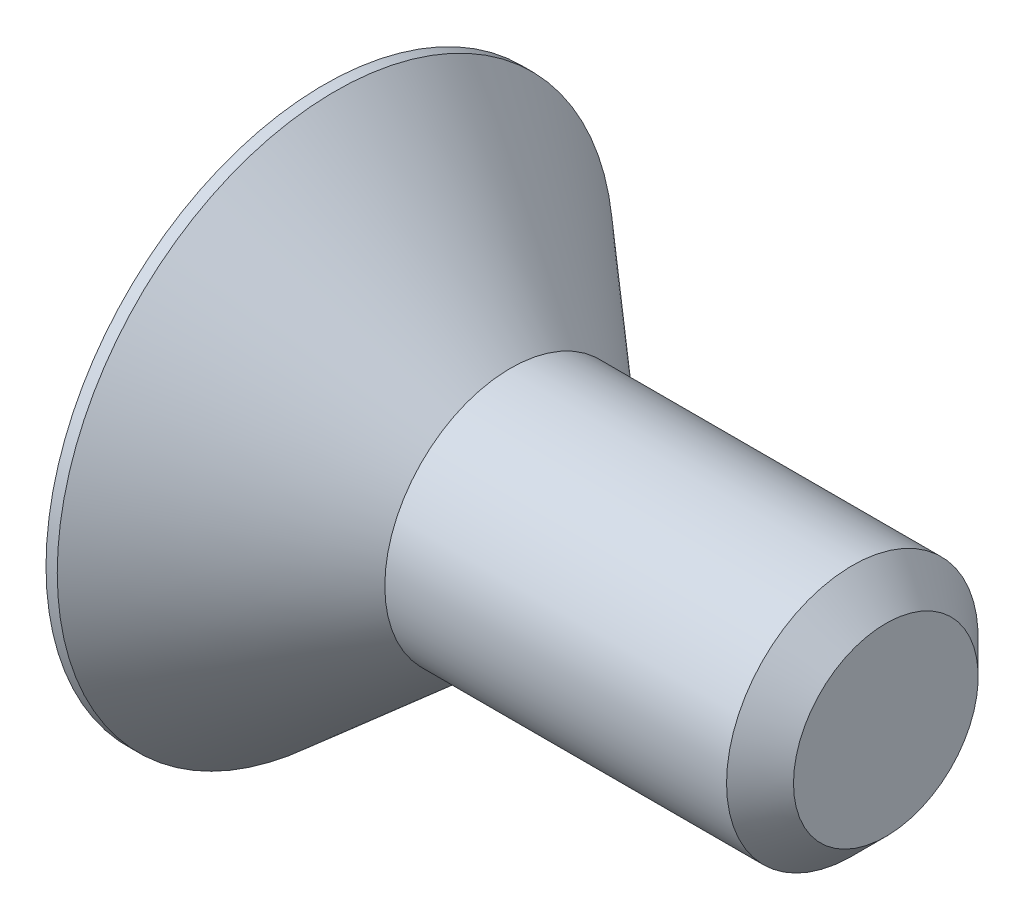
ISO-10303-21;
HEADER;
FILE_DESCRIPTION(('STEP AP214'),'2;1');
FILE_NAME('part.step','',(''),(''),'','','');
FILE_SCHEMA(('AUTOMOTIVE_DESIGN { 1 0 10303 214 1 1 1 1 }'));
ENDSEC;
DATA;
#1=APPLICATION_CONTEXT('core data for automotive mechanical design processes');
#2=APPLICATION_PROTOCOL_DEFINITION('international standard','automotive_design',2000,#1);
#3=PRODUCT_CONTEXT('',#1,'mechanical');
#4=PRODUCT('Part','Part','',(#3));
#5=PRODUCT_RELATED_PRODUCT_CATEGORY('part','',(#4));
#6=PRODUCT_DEFINITION_FORMATION('','',#4);
#7=PRODUCT_DEFINITION_CONTEXT('part definition',#1,'design');
#8=PRODUCT_DEFINITION('design','',#6,#7);
#9=PRODUCT_DEFINITION_SHAPE('','',#8);
#10=(LENGTH_UNIT() NAMED_UNIT(*) SI_UNIT(.MILLI.,.METRE.));
#11=(NAMED_UNIT(*) PLANE_ANGLE_UNIT() SI_UNIT($,.RADIAN.));
#12=(NAMED_UNIT(*) SI_UNIT($,.STERADIAN.) SOLID_ANGLE_UNIT());
#13=UNCERTAINTY_MEASURE_WITH_UNIT(LENGTH_MEASURE(1.E-05),#10,'distance_accuracy_value','');
#14=(GEOMETRIC_REPRESENTATION_CONTEXT(3) GLOBAL_UNCERTAINTY_ASSIGNED_CONTEXT((#13)) GLOBAL_UNIT_ASSIGNED_CONTEXT((#10,
#11,#12)) REPRESENTATION_CONTEXT('',''));
#15=CARTESIAN_POINT('',(0.,0.,0.));
#16=DIRECTION('',(0.,0.,1.));
#17=DIRECTION('',(1.,0.,0.));
#18=AXIS2_PLACEMENT_3D('',#15,#16,#17);
#19=CARTESIAN_POINT('',(0.,0.,0.));
#20=DIRECTION('',(-1.,0.,0.));
#21=DIRECTION('',(0.,0.,1.));
#22=AXIS2_PLACEMENT_3D('',#19,#20,#21);
#23=PLANE('',#22);
#24=CARTESIAN_POINT('',(0.,0.,0.));
#25=DIRECTION('',(-1.,0.,0.));
#26=DIRECTION('',(0.,0.,1.));
#27=AXIS2_PLACEMENT_3D('',#24,#25,#26);
#28=CIRCLE('',#27,3.14452);
#29=CARTESIAN_POINT('',(0.,0.,3.14452));
#30=VERTEX_POINT('',#29);
#31=EDGE_CURVE('E11',#30,#30,#28,.T.);
#32=ORIENTED_EDGE('',*,*,#31,.T.);
#33=EDGE_LOOP('',(#32));
#34=FACE_BOUND('',#33,.T.);
#35=DIRECTION('',(0.,-0.500000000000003,-0.866025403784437));
#36=VECTOR('',#35,1.);
#37=CARTESIAN_POINT('',(0.,-0.458271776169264,0.793749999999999));
#38=LINE('',#37,#36);
#39=CARTESIAN_POINT('',(0.,-0.458271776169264,0.793749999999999));
#40=VERTEX_POINT('',#39);
#41=CARTESIAN_POINT('',(0.,-0.916543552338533,0.));
#42=VERTEX_POINT('',#41);
#43=EDGE_CURVE('E117',#40,#42,#38,.T.);
#44=ORIENTED_EDGE('',*,*,#43,.T.);
#45=DIRECTION('',(0.,0.500000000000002,-0.866025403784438));
#46=VECTOR('',#45,1.);
#47=CARTESIAN_POINT('',(0.,-0.916543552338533,0.));
#48=LINE('',#47,#46);
#49=CARTESIAN_POINT('',(0.,-0.458271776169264,-0.793750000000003));
#50=VERTEX_POINT('',#49);
#51=EDGE_CURVE('E47',#42,#50,#48,.T.);
#52=ORIENTED_EDGE('',*,*,#51,.T.);
#53=DIRECTION('',(0.,1.,0.));
#54=VECTOR('',#53,1.);
#55=CARTESIAN_POINT('',(0.,-0.458271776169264,-0.793750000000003));
#56=LINE('',#55,#54);
#57=CARTESIAN_POINT('',(0.,0.458271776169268,-0.79375));
#58=VERTEX_POINT('',#57);
#59=EDGE_CURVE('E132',#50,#58,#56,.T.);
#60=ORIENTED_EDGE('',*,*,#59,.T.);
#61=DIRECTION('',(0.,0.500000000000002,0.866025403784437));
#62=VECTOR('',#61,1.);
#63=CARTESIAN_POINT('',(0.,0.458271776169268,-0.79375));
#64=LINE('',#63,#62);
#65=CARTESIAN_POINT('',(0.,0.916543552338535,0.));
#66=VERTEX_POINT('',#65);
#67=EDGE_CURVE('E202',#58,#66,#64,.T.);
#68=ORIENTED_EDGE('',*,*,#67,.T.);
#69=DIRECTION('',(0.,-0.5,0.866025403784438));
#70=VECTOR('',#69,1.);
#71=CARTESIAN_POINT('',(0.,0.916543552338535,0.));
#72=LINE('',#71,#70);
#73=CARTESIAN_POINT('',(0.,0.458271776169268,0.793749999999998));
#74=VERTEX_POINT('',#73);
#75=EDGE_CURVE('E186',#66,#74,#72,.T.);
#76=ORIENTED_EDGE('',*,*,#75,.T.);
#77=DIRECTION('',(0.,-1.,0.));
#78=VECTOR('',#77,1.);
#79=CARTESIAN_POINT('',(0.,0.458271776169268,0.793749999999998));
#80=LINE('',#79,#78);
#81=EDGE_CURVE('E181',#74,#40,#80,.T.);
#82=ORIENTED_EDGE('',*,*,#81,.T.);
#83=EDGE_LOOP('',(#44,#52,#60,#68,#76,#82));
#84=FACE_BOUND('',#83,.T.);
#85=ADVANCED_FACE('F33',(#34,#84),#23,.T.);
#86=CARTESIAN_POINT('',(0.,0.,0.));
#87=DIRECTION('',(-1.,0.,0.));
#88=DIRECTION('',(0.,0.,1.));
#89=AXIS2_PLACEMENT_3D('',#86,#87,#88);
#90=CYLINDRICAL_SURFACE('',#89,3.14452);
#91=CARTESIAN_POINT('',(0.127,0.,0.));
#92=DIRECTION('',(-1.,0.,0.));
#93=DIRECTION('',(0.,0.,1.));
#94=AXIS2_PLACEMENT_3D('',#91,#92,#93);
#95=CIRCLE('',#94,3.14452);
#96=CARTESIAN_POINT('',(0.127,0.,3.14452));
#97=VERTEX_POINT('',#96);
#98=EDGE_CURVE('E40',#97,#97,#95,.T.);
#99=ORIENTED_EDGE('',*,*,#98,.T.);
#100=EDGE_LOOP('',(#99));
#101=FACE_BOUND('',#100,.T.);
#102=ORIENTED_EDGE('',*,*,#31,.F.);
#103=EDGE_LOOP('',(#102));
#104=FACE_BOUND('',#103,.T.);
#105=ADVANCED_FACE('F157',(#101,#104),#90,.T.);
#106=CARTESIAN_POINT('',(0.127,0.,0.));
#107=DIRECTION('',(-1.,0.,0.));
#108=DIRECTION('',(0.,0.,1.));
#109=AXIS2_PLACEMENT_3D('',#106,#107,#108);
#110=CONICAL_SURFACE('',#109,3.14452,0.715584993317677);
#111=CARTESIAN_POINT('',(2.10807244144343,0.,0.));
#112=DIRECTION('',(-1.,0.,0.));
#113=DIRECTION('',(0.,0.,1.));
#114=AXIS2_PLACEMENT_3D('',#111,#112,#113);
#115=CIRCLE('',#114,1.4224);
#116=CARTESIAN_POINT('',(2.10807244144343,0.,1.4224));
#117=VERTEX_POINT('',#116);
#118=EDGE_CURVE('E152',#117,#117,#115,.T.);
#119=ORIENTED_EDGE('',*,*,#118,.T.);
#120=EDGE_LOOP('',(#119));
#121=FACE_BOUND('',#120,.T.);
#122=ORIENTED_EDGE('',*,*,#98,.F.);
#123=EDGE_LOOP('',(#122));
#124=FACE_BOUND('',#123,.T.);
#125=ADVANCED_FACE('F160',(#121,#124),#110,.T.);
#126=CARTESIAN_POINT('',(0.,0.,0.));
#127=DIRECTION('',(-1.,0.,0.));
#128=DIRECTION('',(0.,0.,1.));
#129=AXIS2_PLACEMENT_3D('',#126,#127,#128);
#130=CYLINDRICAL_SURFACE('',#129,1.4224);
#131=CARTESIAN_POINT('',(5.97154000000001,0.,0.));
#132=DIRECTION('',(-1.,0.,0.));
#133=DIRECTION('',(0.,0.,1.));
#134=AXIS2_PLACEMENT_3D('',#131,#132,#133);
#135=CIRCLE('',#134,1.4224);
#136=CARTESIAN_POINT('',(5.97154000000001,0.,1.4224));
#137=VERTEX_POINT('',#136);
#138=EDGE_CURVE('E149',#137,#137,#135,.T.);
#139=ORIENTED_EDGE('',*,*,#138,.T.);
#140=EDGE_LOOP('',(#139));
#141=FACE_BOUND('',#140,.T.);
#142=ORIENTED_EDGE('',*,*,#118,.F.);
#143=EDGE_LOOP('',(#142));
#144=FACE_BOUND('',#143,.T.);
#145=ADVANCED_FACE('F162',(#141,#144),#130,.T.);
#146=CARTESIAN_POINT('',(6.34999999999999,0.,0.));
#147=DIRECTION('',(-1.,0.,0.));
#148=DIRECTION('',(0.,0.,1.));
#149=AXIS2_PLACEMENT_3D('',#146,#147,#148);
#150=CONICAL_SURFACE('',#149,1.04394,0.785398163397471);
#151=ORIENTED_EDGE('',*,*,#138,.F.);
#152=EDGE_LOOP('',(#151));
#153=FACE_BOUND('',#152,.T.);
#154=CARTESIAN_POINT('',(6.34999999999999,0.,0.));
#155=DIRECTION('',(-1.,0.,0.));
#156=DIRECTION('',(0.,0.,1.));
#157=AXIS2_PLACEMENT_3D('',#154,#155,#156);
#158=CIRCLE('',#157,1.04394);
#159=CARTESIAN_POINT('',(6.34999999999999,0.,1.04394));
#160=VERTEX_POINT('',#159);
#161=EDGE_CURVE('E145',#160,#160,#158,.T.);
#162=ORIENTED_EDGE('',*,*,#161,.T.);
#163=EDGE_LOOP('',(#162));
#164=FACE_BOUND('',#163,.T.);
#165=ADVANCED_FACE('F169',(#153,#164),#150,.T.);
#166=CARTESIAN_POINT('',(6.34999999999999,1.04394,0.));
#167=DIRECTION('',(1.,0.,0.));
#168=DIRECTION('',(0.,0.,-1.));
#169=AXIS2_PLACEMENT_3D('',#166,#167,#168);
#170=PLANE('',#169);
#171=ORIENTED_EDGE('',*,*,#161,.F.);
#172=EDGE_LOOP('',(#171));
#173=FACE_BOUND('',#172,.T.);
#174=ADVANCED_FACE('F257',(#173),#170,.T.);
#175=CARTESIAN_POINT('',(1.397,-0.916543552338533,0.));
#176=DIRECTION('',(0.,0.866025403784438,0.500000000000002));
#177=DIRECTION('',(0.,-0.500000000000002,0.866025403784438));
#178=AXIS2_PLACEMENT_3D('',#175,#176,#177);
#179=PLANE('',#178);
#180=ORIENTED_EDGE('',*,*,#51,.F.);
#181=DIRECTION('',(-1.,0.,0.));
#182=VECTOR('',#181,1.);
#183=CARTESIAN_POINT('',(1.397,-0.916543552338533,0.));
#184=LINE('',#183,#182);
#185=CARTESIAN_POINT('',(1.397,-0.916543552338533,0.));
#186=VERTEX_POINT('',#185);
#187=EDGE_CURVE('E190',#186,#42,#184,.T.);
#188=ORIENTED_EDGE('',*,*,#187,.F.);
#189=DIRECTION('',(0.,0.500000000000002,-0.866025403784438));
#190=VECTOR('',#189,1.);
#191=CARTESIAN_POINT('',(1.397,-0.916543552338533,0.));
#192=LINE('',#191,#190);
#193=CARTESIAN_POINT('',(1.397,-0.687407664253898,-0.396875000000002));
#194=VERTEX_POINT('',#193);
#195=EDGE_CURVE('E114',#186,#194,#192,.T.);
#196=ORIENTED_EDGE('',*,*,#195,.T.);
#197=CARTESIAN_POINT('',(1.397,-0.458271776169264,-0.793750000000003));
#198=VERTEX_POINT('',#197);
#199=EDGE_CURVE('E108',#194,#198,#192,.T.);
#200=ORIENTED_EDGE('',*,*,#199,.T.);
#201=DIRECTION('',(-1.,0.,0.));
#202=VECTOR('',#201,1.);
#203=CARTESIAN_POINT('',(1.397,-0.458271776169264,-0.793750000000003));
#204=LINE('',#203,#202);
#205=EDGE_CURVE('E112',#198,#50,#204,.T.);
#206=ORIENTED_EDGE('',*,*,#205,.T.);
#207=EDGE_LOOP('',(#180,#188,#196,#200,#206));
#208=FACE_BOUND('',#207,.T.);
#209=ADVANCED_FACE('F110',(#208),#179,.T.);
#210=CARTESIAN_POINT('',(1.397,-0.458271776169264,-0.793750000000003));
#211=DIRECTION('',(0.,0.,1.));
#212=DIRECTION('',(0.,-1.,0.));
#213=AXIS2_PLACEMENT_3D('',#210,#211,#212);
#214=PLANE('',#213);
#215=ORIENTED_EDGE('',*,*,#59,.F.);
#216=ORIENTED_EDGE('',*,*,#205,.F.);
#217=DIRECTION('',(0.,1.,0.));
#218=VECTOR('',#217,1.);
#219=CARTESIAN_POINT('',(1.397,-0.458271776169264,-0.793750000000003));
#220=LINE('',#219,#218);
#221=CARTESIAN_POINT('',(1.397,0.,-0.793750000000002));
#222=VERTEX_POINT('',#221);
#223=EDGE_CURVE('E120',#198,#222,#220,.T.);
#224=ORIENTED_EDGE('',*,*,#223,.T.);
#225=CARTESIAN_POINT('',(1.397,0.458271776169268,-0.79375));
#226=VERTEX_POINT('',#225);
#227=EDGE_CURVE('E127',#222,#226,#220,.T.);
#228=ORIENTED_EDGE('',*,*,#227,.T.);
#229=DIRECTION('',(-1.,0.,0.));
#230=VECTOR('',#229,1.);
#231=CARTESIAN_POINT('',(1.397,0.458271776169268,-0.79375));
#232=LINE('',#231,#230);
#233=EDGE_CURVE('E134',#226,#58,#232,.T.);
#234=ORIENTED_EDGE('',*,*,#233,.T.);
#235=EDGE_LOOP('',(#215,#216,#224,#228,#234));
#236=FACE_BOUND('',#235,.T.);
#237=ADVANCED_FACE('F129',(#236),#214,.T.);
#238=CARTESIAN_POINT('',(1.397,0.458271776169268,-0.79375));
#239=DIRECTION('',(0.,-0.866025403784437,0.500000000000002));
#240=DIRECTION('',(0.,-0.500000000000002,-0.866025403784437));
#241=AXIS2_PLACEMENT_3D('',#238,#239,#240);
#242=PLANE('',#241);
#243=ORIENTED_EDGE('',*,*,#67,.F.);
#244=ORIENTED_EDGE('',*,*,#233,.F.);
#245=DIRECTION('',(0.,0.500000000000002,0.866025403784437));
#246=VECTOR('',#245,1.);
#247=CARTESIAN_POINT('',(1.397,0.458271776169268,-0.79375));
#248=LINE('',#247,#246);
#249=CARTESIAN_POINT('',(1.397,0.6874076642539,-0.396875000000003));
#250=VERTEX_POINT('',#249);
#251=EDGE_CURVE('E218',#226,#250,#248,.T.);
#252=ORIENTED_EDGE('',*,*,#251,.T.);
#253=CARTESIAN_POINT('',(1.397,0.916543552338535,0.));
#254=VERTEX_POINT('',#253);
#255=EDGE_CURVE('E126',#250,#254,#248,.T.);
#256=ORIENTED_EDGE('',*,*,#255,.T.);
#257=DIRECTION('',(-1.,0.,0.));
#258=VECTOR('',#257,1.);
#259=CARTESIAN_POINT('',(1.397,0.916543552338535,0.));
#260=LINE('',#259,#258);
#261=EDGE_CURVE('E140',#254,#66,#260,.T.);
#262=ORIENTED_EDGE('',*,*,#261,.T.);
#263=EDGE_LOOP('',(#243,#244,#252,#256,#262));
#264=FACE_BOUND('',#263,.T.);
#265=ADVANCED_FACE('F200',(#264),#242,.T.);
#266=CARTESIAN_POINT('',(1.397,0.916543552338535,0.));
#267=DIRECTION('',(0.,-0.866025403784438,-0.5));
#268=DIRECTION('',(0.,0.5,-0.866025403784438));
#269=AXIS2_PLACEMENT_3D('',#266,#267,#268);
#270=PLANE('',#269);
#271=ORIENTED_EDGE('',*,*,#75,.F.);
#272=ORIENTED_EDGE('',*,*,#261,.F.);
#273=DIRECTION('',(0.,-0.5,0.866025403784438));
#274=VECTOR('',#273,1.);
#275=CARTESIAN_POINT('',(1.397,0.916543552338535,0.));
#276=LINE('',#275,#274);
#277=CARTESIAN_POINT('',(1.397,0.687407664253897,0.396875));
#278=VERTEX_POINT('',#277);
#279=EDGE_CURVE('E55',#254,#278,#276,.T.);
#280=ORIENTED_EDGE('',*,*,#279,.T.);
#281=CARTESIAN_POINT('',(1.397,0.458271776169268,0.793749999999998));
#282=VERTEX_POINT('',#281);
#283=EDGE_CURVE('E217',#278,#282,#276,.T.);
#284=ORIENTED_EDGE('',*,*,#283,.T.);
#285=DIRECTION('',(-1.,0.,0.));
#286=VECTOR('',#285,1.);
#287=CARTESIAN_POINT('',(1.397,0.458271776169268,0.793749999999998));
#288=LINE('',#287,#286);
#289=EDGE_CURVE('E195',#282,#74,#288,.T.);
#290=ORIENTED_EDGE('',*,*,#289,.T.);
#291=EDGE_LOOP('',(#271,#272,#280,#284,#290));
#292=FACE_BOUND('',#291,.T.);
#293=ADVANCED_FACE('F241',(#292),#270,.T.);
#294=CARTESIAN_POINT('',(1.397,0.458271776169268,0.793749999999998));
#295=DIRECTION('',(0.,0.,-1.));
#296=DIRECTION('',(0.,1.,0.));
#297=AXIS2_PLACEMENT_3D('',#294,#295,#296);
#298=PLANE('',#297);
#299=ORIENTED_EDGE('',*,*,#81,.F.);
#300=ORIENTED_EDGE('',*,*,#289,.F.);
#301=DIRECTION('',(0.,-1.,0.));
#302=VECTOR('',#301,1.);
#303=CARTESIAN_POINT('',(1.397,0.458271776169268,0.793749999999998));
#304=LINE('',#303,#302);
#305=CARTESIAN_POINT('',(1.397,0.,0.793749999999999));
#306=VERTEX_POINT('',#305);
#307=EDGE_CURVE('E212',#282,#306,#304,.T.);
#308=ORIENTED_EDGE('',*,*,#307,.T.);
#309=CARTESIAN_POINT('',(1.397,-0.458271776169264,0.793749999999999));
#310=VERTEX_POINT('',#309);
#311=EDGE_CURVE('E215',#306,#310,#304,.T.);
#312=ORIENTED_EDGE('',*,*,#311,.T.);
#313=DIRECTION('',(-1.,0.,0.));
#314=VECTOR('',#313,1.);
#315=CARTESIAN_POINT('',(1.397,-0.458271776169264,0.793749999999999));
#316=LINE('',#315,#314);
#317=EDGE_CURVE('E192',#310,#40,#316,.T.);
#318=ORIENTED_EDGE('',*,*,#317,.T.);
#319=EDGE_LOOP('',(#299,#300,#308,#312,#318));
#320=FACE_BOUND('',#319,.T.);
#321=ADVANCED_FACE('F240',(#320),#298,.T.);
#322=CARTESIAN_POINT('',(1.397,-0.458271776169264,0.793749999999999));
#323=DIRECTION('',(0.,0.866025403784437,-0.500000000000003));
#324=DIRECTION('',(0.,0.500000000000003,0.866025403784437));
#325=AXIS2_PLACEMENT_3D('',#322,#323,#324);
#326=PLANE('',#325);
#327=ORIENTED_EDGE('',*,*,#43,.F.);
#328=ORIENTED_EDGE('',*,*,#317,.F.);
#329=DIRECTION('',(0.,-0.500000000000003,-0.866025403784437));
#330=VECTOR('',#329,1.);
#331=CARTESIAN_POINT('',(1.397,-0.458271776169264,0.793749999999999));
#332=LINE('',#331,#330);
#333=CARTESIAN_POINT('',(1.397,-0.687407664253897,0.396875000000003));
#334=VERTEX_POINT('',#333);
#335=EDGE_CURVE('E193',#310,#334,#332,.T.);
#336=ORIENTED_EDGE('',*,*,#335,.T.);
#337=EDGE_CURVE('E211',#334,#186,#332,.T.);
#338=ORIENTED_EDGE('',*,*,#337,.T.);
#339=ORIENTED_EDGE('',*,*,#187,.T.);
#340=EDGE_LOOP('',(#327,#328,#336,#338,#339));
#341=FACE_BOUND('',#340,.T.);
#342=ADVANCED_FACE('F248',(#341),#326,.T.);
#343=CARTESIAN_POINT('',(1.397,-0.916543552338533,0.));
#344=DIRECTION('',(-1.,0.,0.));
#345=DIRECTION('',(0.,0.,1.));
#346=AXIS2_PLACEMENT_3D('',#343,#344,#345);
#347=PLANE('',#346);
#348=CARTESIAN_POINT('',(1.397,0.,0.));
#349=DIRECTION('',(-1.,0.,0.));
#350=DIRECTION('',(0.,0.,1.));
#351=AXIS2_PLACEMENT_3D('',#348,#349,#350);
#352=CIRCLE('',#351,0.793749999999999);
#353=EDGE_CURVE('E133',#334,#306,#352,.T.);
#354=ORIENTED_EDGE('',*,*,#353,.F.);
#355=ORIENTED_EDGE('',*,*,#335,.F.);
#356=ORIENTED_EDGE('',*,*,#311,.F.);
#357=EDGE_LOOP('',(#354,#355,#356));
#358=FACE_BOUND('',#357,.T.);
#359=ADVANCED_FACE('F236',(#358),#347,.T.);
#360=EDGE_CURVE('E137',#194,#334,#352,.T.);
#361=ORIENTED_EDGE('',*,*,#360,.F.);
#362=ORIENTED_EDGE('',*,*,#195,.F.);
#363=ORIENTED_EDGE('',*,*,#337,.F.);
#364=EDGE_LOOP('',(#361,#362,#363));
#365=FACE_BOUND('',#364,.T.);
#366=ADVANCED_FACE('F317',(#365),#347,.T.);
#367=EDGE_CURVE('E122',#222,#194,#352,.T.);
#368=ORIENTED_EDGE('',*,*,#367,.F.);
#369=ORIENTED_EDGE('',*,*,#223,.F.);
#370=ORIENTED_EDGE('',*,*,#199,.F.);
#371=EDGE_LOOP('',(#368,#369,#370));
#372=FACE_BOUND('',#371,.T.);
#373=ADVANCED_FACE('F121',(#372),#347,.T.);
#374=EDGE_CURVE('E223',#250,#222,#352,.T.);
#375=ORIENTED_EDGE('',*,*,#374,.F.);
#376=ORIENTED_EDGE('',*,*,#251,.F.);
#377=ORIENTED_EDGE('',*,*,#227,.F.);
#378=EDGE_LOOP('',(#375,#376,#377));
#379=FACE_BOUND('',#378,.T.);
#380=ADVANCED_FACE('F222',(#379),#347,.T.);
#381=EDGE_CURVE('E146',#278,#250,#352,.T.);
#382=ORIENTED_EDGE('',*,*,#381,.F.);
#383=ORIENTED_EDGE('',*,*,#279,.F.);
#384=ORIENTED_EDGE('',*,*,#255,.F.);
#385=EDGE_LOOP('',(#382,#383,#384));
#386=FACE_BOUND('',#385,.T.);
#387=ADVANCED_FACE('F227',(#386),#347,.T.);
#388=EDGE_CURVE('E139',#306,#278,#352,.T.);
#389=ORIENTED_EDGE('',*,*,#388,.F.);
#390=ORIENTED_EDGE('',*,*,#307,.F.);
#391=ORIENTED_EDGE('',*,*,#283,.F.);
#392=EDGE_LOOP('',(#389,#390,#391));
#393=FACE_BOUND('',#392,.T.);
#394=ADVANCED_FACE('F233',(#393),#347,.T.);
#395=CARTESIAN_POINT('',(1.397,0.,0.));
#396=DIRECTION('',(-1.,0.,0.));
#397=DIRECTION('',(0.,0.,1.));
#398=AXIS2_PLACEMENT_3D('',#395,#396,#397);
#399=CONICAL_SURFACE('',#398,0.793749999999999,1.04719755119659);
#400=CARTESIAN_POINT('',(1.85527177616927,0.,0.));
#401=VERTEX_POINT('',#400);
#402=VERTEX_LOOP('',#401);
#403=FACE_BOUND('',#402,.T.);
#404=ORIENTED_EDGE('',*,*,#388,.T.);
#405=ORIENTED_EDGE('',*,*,#381,.T.);
#406=ORIENTED_EDGE('',*,*,#374,.T.);
#407=ORIENTED_EDGE('',*,*,#367,.T.);
#408=ORIENTED_EDGE('',*,*,#360,.T.);
#409=ORIENTED_EDGE('',*,*,#353,.T.);
#410=EDGE_LOOP('',(#404,#405,#406,#407,#408,#409));
#411=FACE_BOUND('',#410,.T.);
#412=ADVANCED_FACE('F228',(#403,#411),#399,.F.);
#413=CLOSED_SHELL('',(#85,#105,#125,#145,#165,#174,#209,#237,#265,#293,#321,#342,#359,#366,#373,
#380,#387,#394,#412));
#414=MANIFOLD_SOLID_BREP('B2',#413);
#415=ADVANCED_BREP_SHAPE_REPRESENTATION('',(#18,#414),#14);
#416=SHAPE_DEFINITION_REPRESENTATION(#9,#415);
ENDSEC;
END-ISO-10303-21;
